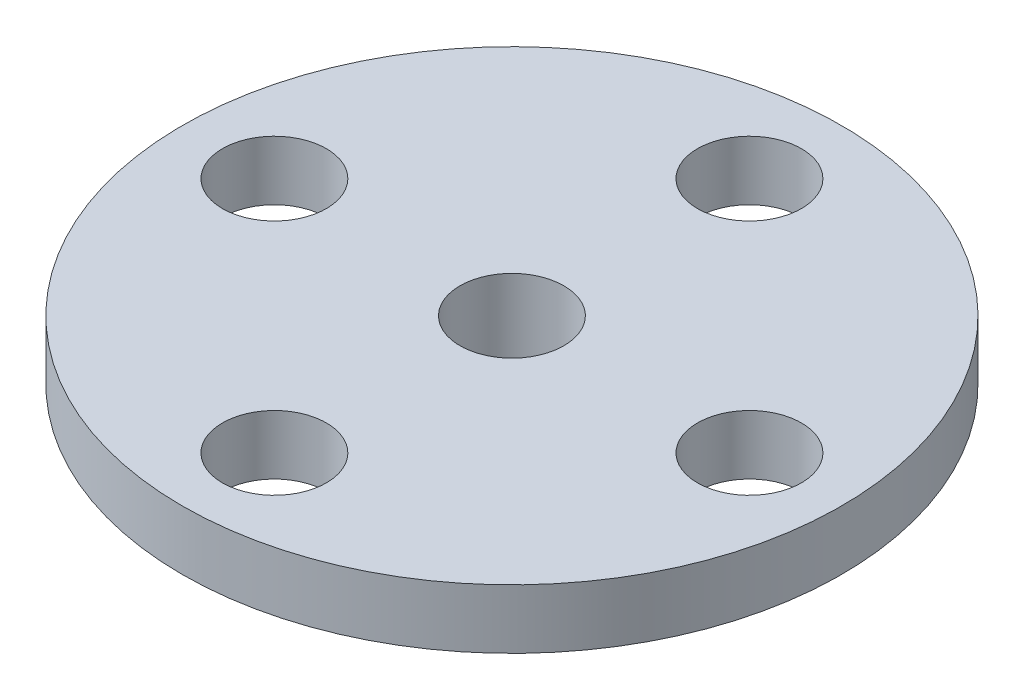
from build123d import *

# Parameters (mm, degrees)
SKETCH1_R          = 11.1
EXTRUDE1_DEPTH     = 2
SKETCH2_R          = 1.75
CUT_EXTRUDE1_DEPTH = 16.824664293
SKETCH3_R          = 4.4
EXTRUDE2_DEPTH     = 4.2
SKETCH4_R          = 2.85
CUT_EXTRUDE2_DEPTH = 3
SKETCH5_R          = 1.75
CUT_EXTRUDE3_DEPTH = 17.020611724


with BuildPart() as part:
    # Sketch1 → Extrude1 (new body)
    with BuildSketch(Plane(origin=(0, 0, 0), x_dir=(1, 0, 0), z_dir=(0, 1, 0))):
        with Locations(Location((0, 0, 0), (0, 0, 270))):
            Circle(SKETCH1_R)
    extrude(amount=EXTRUDE1_DEPTH)

    # Sketch2 → Cut-Extrude1 (cut, through all)
    with BuildSketch(Plane(origin=(0, 2, 0), x_dir=(1, 0, 0), z_dir=(0, 1, 0))):
        with Locations(Location((0, 8, 0), (0, 0, 270))):
            Circle(SKETCH2_R)
        with Locations(Location((8, 0, 0), (0, 0, 270))):
            Circle(SKETCH2_R)
        with Locations(Location((0, -8, 0), (0, 0, 270))):
            Circle(SKETCH2_R)
        with Locations(Location((-8, 0, 0), (0, 0, 270))):
            Circle(SKETCH2_R)
    extrude(amount=-CUT_EXTRUDE1_DEPTH, mode=Mode.SUBTRACT)

    # Sketch3 → Extrude2 (add)
    with BuildSketch(Plane.XZ):
        with Locations(Location((0, 0, 0), (0, 0, 90))):
            Circle(SKETCH3_R)
    extrude(amount=EXTRUDE2_DEPTH)

    # Sketch4 → Cut-Extrude2 (cut)
    with BuildSketch(Plane.XZ.offset(4.2)):
        with Locations(Location((0, 0, 0), (0, 0, 270))):
            Circle(SKETCH4_R)
    extrude(amount=-CUT_EXTRUDE2_DEPTH, mode=Mode.SUBTRACT)

    # Sketch5 → Cut-Extrude3 (cut, through all)
    with BuildSketch(Plane.XZ.offset(1.2)):
        with Locations(Location((0, 0, 0), (0, 0, 270))):
            Circle(SKETCH5_R)
    extrude(amount=-CUT_EXTRUDE3_DEPTH, mode=Mode.SUBTRACT)


solid = part.part
